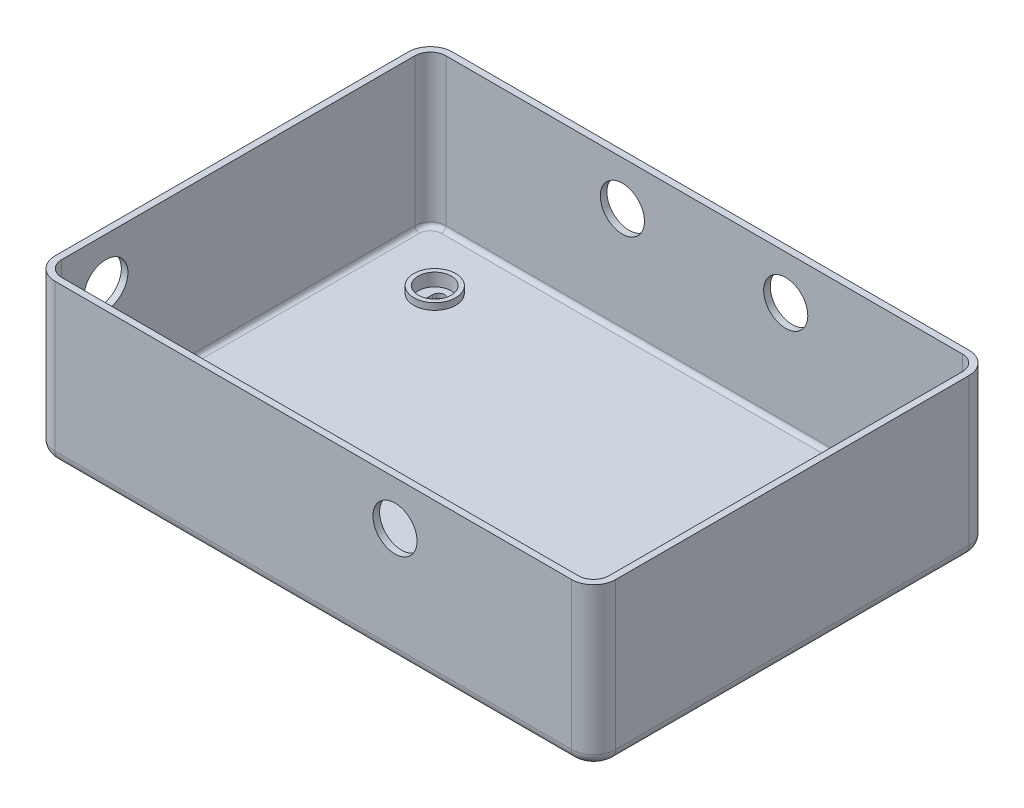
from build123d import *

# Parameters (mm, degrees)
SKIZZE2_W                            = 254
SKIZZE2_H                            = 180
AUFSATZ_LINEAR_AUSTRAGEN1_DEPTH      = 71.7
VERRUNDUNG1_R                        = 10
VERRUNDUNG2_R                        = 5
WANDUNG1_T                           = -3
SCHNITT_LINEAR_AUSTRAGEN1_REACH      = 280.849
SKIZZE3_R                            = 10
SCHNITT_LINEAR_AUSTRAGEN2_REACH      = 233.668
SKIZZE4_R                            = 10
SCHNITT_LINEAR_START                 = -3
SKIZZE5_R                            = 10
SCHNITT_LINEAR_AUSTRAGEN3_DEPTH      = 3
AUFSATZ_LINEAR_AUSTRAGEN2_DEPTH      = 1.8
AUFSATZ_LINEAR_AUSTRAGEN2_DEPTH_BACK = 6
SKIZZE6_R                            = 9.5
SKIZZE10_R                           = 7.5
SCHNITT_LINEAR_AUSTRAGEN6_DEPTH      = 5.8
LINEARES_MUSTER1_COUNT               = 2
LINEARES_MUSTER1_PITCH               = 120
LINEARES_MUSTER1_COUNT_DIR2          = 2
LINEARES_MUSTER1_PITCH_DIR2          = 190
SCHNITT_LINEAR_AUSTRAGEN4_REACH      = 174.137


with BuildPart() as part:
    # Skizze2 → Aufsatz-Linear austragen1 (new body)
    with BuildSketch(Plane(origin=(0, 0, 0), x_dir=(1, 0, 0), z_dir=(0, 1, 0))):
        Rectangle(SKIZZE2_W, SKIZZE2_H)
    extrude(amount=AUFSATZ_LINEAR_AUSTRAGEN1_DEPTH)

    # Verrundung1
    verrundung1_edges = [part.edges().sort_by_distance(p)[0] for p in [
        (-127, 35.85, -90),
        (127, 35.85, -90),
        (127, 35.85, 90),
        (-127, 35.85, 90),
    ]]
    fillet(verrundung1_edges, radius=VERRUNDUNG1_R)

    # Verrundung2
    verrundung2_edges = [part.edges().sort_by_distance(p)[0] for p in [
        (-127, 0, 0),
        (0, 0, -90),
        (127, 0, 0),
        (0, 0, 90),
        (-124.071067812, 0, 87.071067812),
        (124.071067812, 0, 87.071067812),
        (124.071067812, 0, -87.071067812),
        (-124.071067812, 0, -87.071067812),
    ]]
    fillet(verrundung2_edges, radius=VERRUNDUNG2_R)

    # Wandung1
    wandung1_openings = [part.faces().sort_by_distance(p)[0] for p in [
        (0, 71.7, 0),
    ]]
    offset(amount=WANDUNG1_T, openings=wandung1_openings, kind=Kind.INTERSECTION)

    # Skizze3 → Schnitt-Linear austragen1 (cut, up to next)
    with BuildSketch(Plane.ZY.offset(127), mode=Mode.PRIVATE) as schnitt_linear_austragen1_sk1:
        with Locations((60, 51.7)):
            Circle(SKIZZE3_R)
    schnitt_linear_austragen1_tool1 = extrude(schnitt_linear_austragen1_sk1.sketch, amount=-SCHNITT_LINEAR_AUSTRAGEN1_REACH, mode=Mode.PRIVATE) & part.part
    add(schnitt_linear_austragen1_tool1.solids().sort_by_distance((-127, 51.7, 60))[0], mode=Mode.SUBTRACT)

    # Skizze4 → Schnitt-Linear austragen2 (cut, up to next)
    with BuildSketch(Plane(origin=(0, 0, -90), x_dir=(-1, 0, 0), z_dir=(0, 0, -1)), mode=Mode.PRIVATE) as schnitt_linear_austragen2_sk1:
        with Locations((37, 51.7)):
            Circle(SKIZZE4_R)
    schnitt_linear_austragen2_tool1 = extrude(schnitt_linear_austragen2_sk1.sketch, amount=-SCHNITT_LINEAR_AUSTRAGEN2_REACH, mode=Mode.PRIVATE) & part.part
    # Skizze4 → Schnitt-Linear austragen2 (cut, up to next)
    with BuildSketch(Plane(origin=(0, 0, -90), x_dir=(-1, 0, 0), z_dir=(0, 0, -1)), mode=Mode.PRIVATE) as schnitt_linear_austragen2_sk2:
        with Locations((-37, 51.7)):
            Circle(SKIZZE4_R)
    schnitt_linear_austragen2_tool2 = extrude(schnitt_linear_austragen2_sk2.sketch, amount=-SCHNITT_LINEAR_AUSTRAGEN2_REACH, mode=Mode.PRIVATE) & part.part
    add(schnitt_linear_austragen2_tool1.solids().sort_by_distance((-37, 51.7, -90))[0], mode=Mode.SUBTRACT)
    add(schnitt_linear_austragen2_tool2.solids().sort_by_distance((37, 51.7, -90))[0], mode=Mode.SUBTRACT)

    # Skizze5 → Schnitt-Linear austragen3 (cut)
    with BuildSketch(Plane.XY.offset(90).offset(SCHNITT_LINEAR_START)):
        with Locations(Location((37, 51.7, 0), (0, 0, 180))):
            Circle(SKIZZE5_R)
    extrude(amount=SCHNITT_LINEAR_AUSTRAGEN3_DEPTH, mode=Mode.SUBTRACT)

    # Skizze6 → Aufsatz-Linear austragen2 (add, two sides: drawn at the far end of the back side and taken through both)
    with BuildSketch(Plane.XZ.offset(-AUFSATZ_LINEAR_AUSTRAGEN2_DEPTH_BACK)):
        with Locations(Location((-95, 60, 0), (0, 0, 90))):
            Circle(SKIZZE6_R)
        with Locations(Location((95, 60, 0), (0, 0, 90))):
            Circle(SKIZZE6_R)
        with Locations(Location((95, -60, 0), (0, 0, 90))):
            Circle(SKIZZE6_R)
        with Locations(Location((-95, -60, 0), (0, 0, 90))):
            Circle(SKIZZE6_R)
    extrude(amount=AUFSATZ_LINEAR_AUSTRAGEN2_DEPTH + AUFSATZ_LINEAR_AUSTRAGEN2_DEPTH_BACK)

    # Skizze10 → Schnitt-Linear austragen6 (cut)
    with BuildSketch(Plane(origin=(0, 6, 0), x_dir=(1, 0, 0), z_dir=(0, 1, 0))):
        with Locations(Location((95, -60, 0), (0, 0, 270))):
            Circle(SKIZZE10_R)
    schnitt_linear_austragen6 = extrude(amount=-SCHNITT_LINEAR_AUSTRAGEN6_DEPTH, mode=Mode.SUBTRACT)

    # Lineares Muster1: Schnitt-Linear austragen6 2 × 2
    with Locations(*[(-j * LINEARES_MUSTER1_PITCH_DIR2, 0, -i * LINEARES_MUSTER1_PITCH) for i in range(LINEARES_MUSTER1_COUNT) for j in range(LINEARES_MUSTER1_COUNT_DIR2) if (i, j) != (0, 0)]):
        add(schnitt_linear_austragen6, mode=Mode.SUBTRACT)

    # Skizze7 → Schnitt-Linear austragen4 (cut, up to next)
    with BuildSketch(Plane.XZ.offset(1.8), mode=Mode.PRIVATE) as schnitt_linear_austragen4_sk1:
        with BuildLine():
            Line((-97.75, 58.25), (-97.75, 61.75))
            ThreePointArc((-97.75, 61.75), (-95, 64.5), (-92.25, 61.75))
            Line((-92.25, 61.75), (-92.25, 58.25))
            ThreePointArc((-92.25, 58.25), (-95, 55.5), (-97.75, 58.25))
        make_face()
    schnitt_linear_austragen4_tool1 = extrude(schnitt_linear_austragen4_sk1.sketch, amount=-SCHNITT_LINEAR_AUSTRAGEN4_REACH, mode=Mode.PRIVATE) & part.part
    # Skizze7 → Schnitt-Linear austragen4 (cut, up to next)
    with BuildSketch(Plane.XZ.offset(1.8), mode=Mode.PRIVATE) as schnitt_linear_austragen4_sk2:
        with BuildLine():
            Line((-97.75, -61.75), (-97.75, -58.25))
            ThreePointArc((-97.75, -58.25), (-95, -55.5), (-92.25, -58.25))
            Line((-92.25, -58.25), (-92.25, -61.75))
            ThreePointArc((-92.25, -61.75), (-95, -64.5), (-97.75, -61.75))
        make_face()
    schnitt_linear_austragen4_tool2 = extrude(schnitt_linear_austragen4_sk2.sketch, amount=-SCHNITT_LINEAR_AUSTRAGEN4_REACH, mode=Mode.PRIVATE) & part.part
    # Skizze7 → Schnitt-Linear austragen4 (cut, up to next)
    with BuildSketch(Plane.XZ.offset(1.8), mode=Mode.PRIVATE) as schnitt_linear_austragen4_sk3:
        with BuildLine():
            Line((93.25, -57.25), (96.75, -57.25))
            ThreePointArc((96.75, -57.25), (99.5, -60), (96.75, -62.75))
            Line((96.75, -62.75), (93.25, -62.75))
            ThreePointArc((93.25, -62.75), (90.5, -60), (93.25, -57.25))
        make_face()
    schnitt_linear_austragen4_tool3 = extrude(schnitt_linear_austragen4_sk3.sketch, amount=-SCHNITT_LINEAR_AUSTRAGEN4_REACH, mode=Mode.PRIVATE) & part.part
    # Skizze7 → Schnitt-Linear austragen4 (cut, up to next)
    with BuildSketch(Plane.XZ.offset(1.8), mode=Mode.PRIVATE) as schnitt_linear_austragen4_sk4:
        with BuildLine():
            Line((96.75, 57.25), (93.25, 57.25))
            ThreePointArc((93.25, 57.25), (90.5, 60), (93.25, 62.75))
            Line((93.25, 62.75), (96.75, 62.75))
            ThreePointArc((96.75, 62.75), (99.5, 60), (96.75, 57.25))
        make_face()
    schnitt_linear_austragen4_tool4 = extrude(schnitt_linear_austragen4_sk4.sketch, amount=-SCHNITT_LINEAR_AUSTRAGEN4_REACH, mode=Mode.PRIVATE) & part.part
    add(schnitt_linear_austragen4_tool1.solids().sort_by_distance((-95, -1.8, 60))[0], mode=Mode.SUBTRACT)
    add(schnitt_linear_austragen4_tool2.solids().sort_by_distance((-95, -1.8, -60))[0], mode=Mode.SUBTRACT)
    add(schnitt_linear_austragen4_tool3.solids().sort_by_distance((95, -1.8, -60))[0], mode=Mode.SUBTRACT)
    add(schnitt_linear_austragen4_tool4.solids().sort_by_distance((95, -1.8, 60))[0], mode=Mode.SUBTRACT)


solid = part.part
